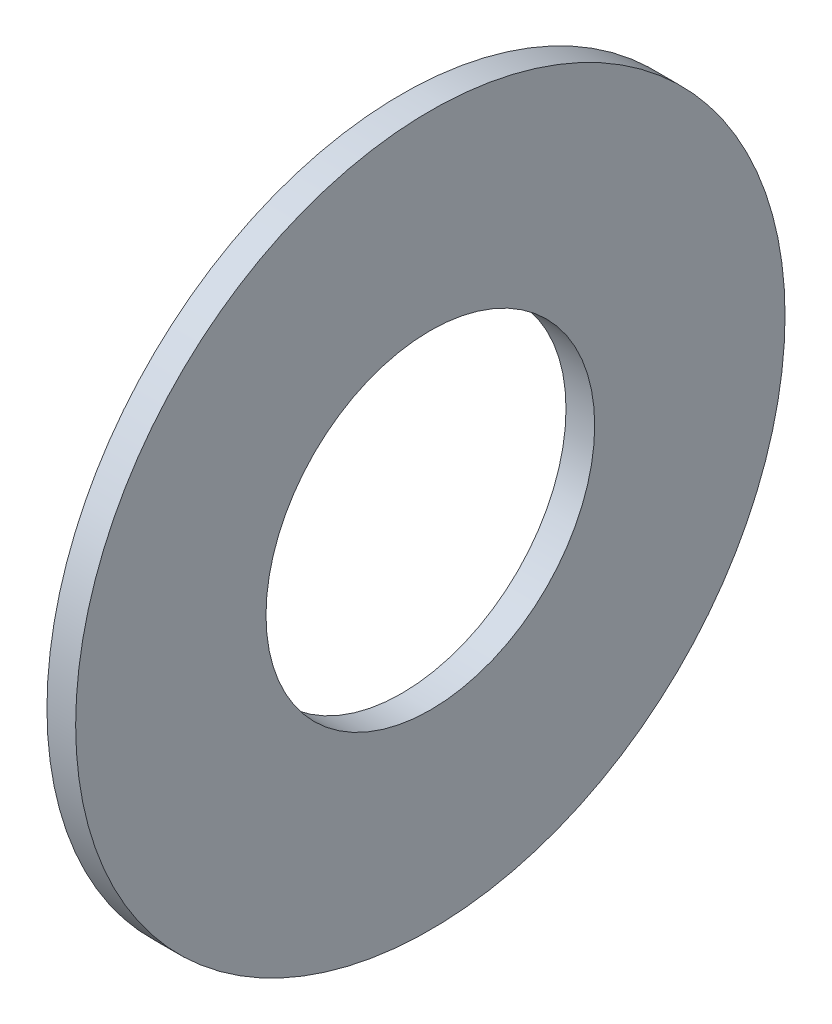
from build123d import *

# Parameters (mm, degrees)
SKETCH1_W = 4.572
SKETCH1_H = 30.3276


with BuildPart() as part:
    # Sketch1 → Base-Revolve (revolve)
    with BuildSketch(Plane.XY, mode=Mode.PRIVATE) as base_revolve_sk:
        with Locations((-2.286, 41.3512)):
            Rectangle(SKETCH1_W, SKETCH1_H)
    revolve(base_revolve_sk.sketch.rotate(Axis((-34.925, 0, 0), (1, 0, 0)), 90), axis=Axis((-34.925, 0, 0), (1, 0, 0)))


solid = part.part
